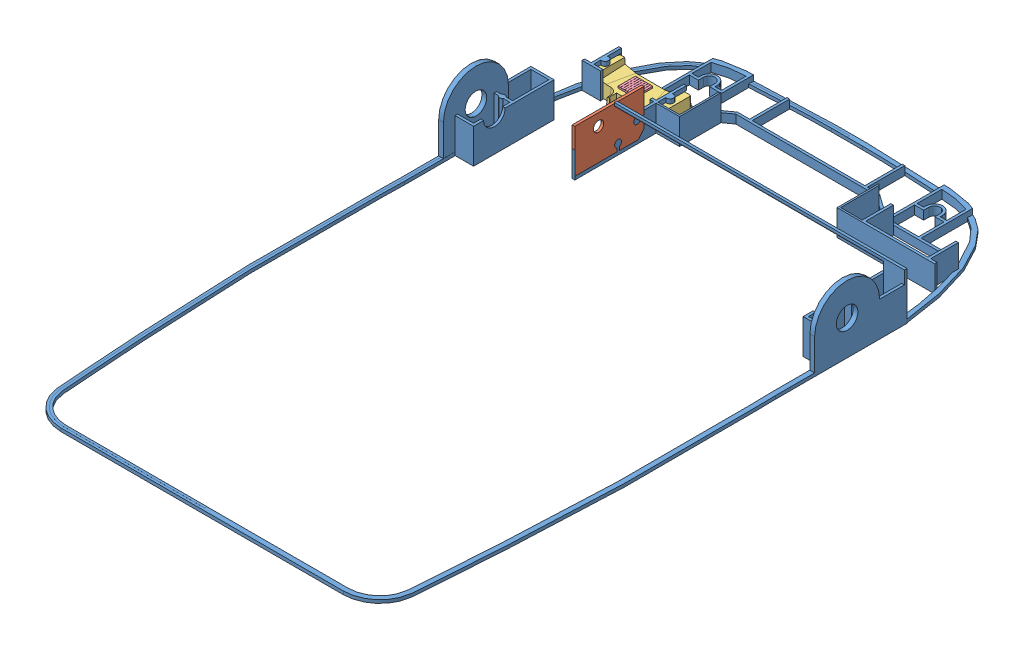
SolidWorks assembly socle.SLDASM, configuration Défaut (file format 4400). Lengths in mm.
Overall size (438.4 77.5 750).
4 component instances, 4 part files, 9 mates.
Components (placement in the parent):
- vig-0-01 socle-1: vig-0-01 socle.sldprt [Défaut] at origin size (438.4 77.5 750)
- Vig-0-10 Support motoreducteur-1: Vig-0-10 Support motoreducteur.SLDPRT [Défaut] at (101.55 3.75 -563.1) size (3 50 80)
- Vig-0-11 Support butee plastique-1: Vig-0-11 Support butee plastique.SLDPRT [Défaut] at (112.05 0 -691) x (-1 0 0) z (0 1 0) size (91.97 42 25)
- VIG-0-12 butee caoutchouc-1: VIG-0-12 butee caoutchouc.SLDPRT [Défaut] at (61.05 13 -675) x (1 0 0) z (0 1 0) size (20 20 4.1)
Mates (geometry in assembly coordinates):
- Coïncidente1: coincident anti-aligned: plane of vig-0-01 socle-1 through (53.321 3.75 -742.897) normal (0 1 0); plane of Vig-0-10 Support motoreducteur-1 through (103.05 3.75 -563.1) normal (0 -1 0)
- Coïncidente2: coincident aligned: plane of vig-0-01 socle-1 through (100.05 30 -692) normal (-1 0 0); plane of Vig-0-10 Support motoreducteur-1 through (100.05 23.75 -635.1) normal (-1 0 0)
- Coïncidente3: coincident aligned: plane of vig-0-01 socle-1 through (103.05 123.9479 -563.1) normal (0 0 1); plane of Vig-0-10 Support motoreducteur-1 through (103.05 3.75 -563.1) normal (0 0 1)
- Coïncidente4: coincident aligned: plane of vig-0-01 socle-1 through (53.321 0 -742.897) normal (0 -1 0); plane of Vig-0-11 Support butee plastique-1 through (84.05 0 -654) normal (0 -1 0)
- Coaxial1: concentric aligned: circle of ?; circle of Vig-0-11 Support butee plastique-1
- Parallèle2: parallel anti-aligned: line of vig-0-01 socle-1 through (28.05 0 -692) axis (1 0 0); line of Vig-0-11 Support butee plastique-1 through (109.05 0 -691) axis (-1 0 0)
- Coïncidente5: coincident anti-aligned: plane of Vig-0-11 Support butee plastique-1 through (71.05 13 -685) normal (0 1 0); plane of VIG-0-12 butee caoutchouc-1 through (51.05 13 -685) normal (0 -1 0)
- Coïncidente6: coincident: line of Vig-0-11 Support butee plastique-1 through (51.05 15 -665) axis (1 0 0); plane of VIG-0-12 butee caoutchouc-1 through (51.05 17 -665) normal (0 0 1)
- Coïncidente8: coincident: line of Vig-0-11 Support butee plastique-1 through (51.05 15 -685) axis (0 0 1); plane of VIG-0-12 butee caoutchouc-1 through (51.05 17 -685) normal (-1 0 0)
